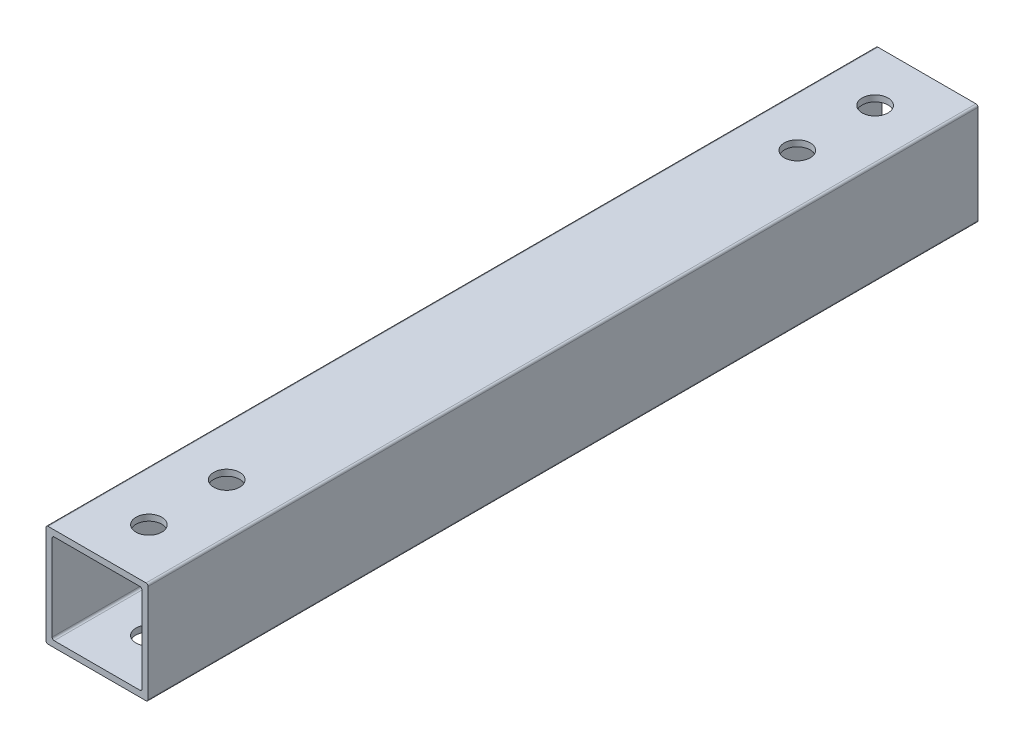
from build123d import *

# Parameters (mm, degrees)
BOSS_EXTRUDE1_DEPTH = 203.2
CUT_EXTRUDE1_REACH  = 2002.195
SKETCH2_R           = 3.175


with BuildPart() as part:
    # Sketch1 → Boss-Extrude1 (new body)
    with BuildSketch(Plane(origin=(0, 0, -2000), x_dir=(-1, 0, 0), z_dir=(0, 0, -1))):
        with BuildLine():
            Line((12.5, -12), (12.5, 12))
            ThreePointArc((12.5, 12), (12.353553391, 12.353553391), (12, 12.5))
            Line((12, 12.5), (-12, 12.5))
            ThreePointArc((-12, 12.5), (-12.353553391, 12.353553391), (-12.5, 12))
            Line((-12.5, 12), (-12.5, -12))
            ThreePointArc((-12.5, -12), (-12.353553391, -12.353553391), (-12, -12.5))
            Line((-12, -12.5), (12, -12.5))
            ThreePointArc((12, -12.5), (12.353553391, -12.353553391), (12.5, -12))
        make_face()
        with BuildLine():
            Line((11, 10.5), (11, -10.5))
            ThreePointArc((11, -10.5), (10.853553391, -10.853553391), (10.5, -11))
            Line((10.5, -11), (-10.5, -11))
            ThreePointArc((-10.5, -11), (-10.853553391, -10.853553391), (-11, -10.5))
            Line((-11, -10.5), (-11, 10.5))
            ThreePointArc((-11, 10.5), (-10.853553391, 10.853553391), (-10.5, 11))
            Line((-10.5, 11), (10.5, 11))
            ThreePointArc((10.5, 11), (10.853553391, 10.853553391), (11, 10.5))
        make_face(mode=Mode.SUBTRACT)
    extrude(amount=-BOSS_EXTRUDE1_DEPTH)

    # Cut-Extrude1: up to this face of the body (flat: up to its plane)
    cut_extrude1_end = Plane(part.part.faces().sort_by_distance((0, -12.5, -1898.4))[0])
    # Sketch2 → Cut-Extrude1 (cut, up to the picked face)
    with BuildSketch(Plane(origin=(0, 12.5, 0), x_dir=(1, 0, 0), z_dir=(0, 1, 0)), mode=Mode.PRIVATE) as cut_extrude1_sk1:
        with Locations(Location((0, 1987.3, 0), (0, 0, 180))):
            Circle(SKETCH2_R)
    cut_extrude1_tool1 = split(extrude(cut_extrude1_sk1.sketch, amount=-CUT_EXTRUDE1_REACH, mode=Mode.PRIVATE), bisect_by=cut_extrude1_end, keep=Keep.BOTH, mode=Mode.PRIVATE)
    # Sketch2 → Cut-Extrude1 (cut, up to the picked face)
    with BuildSketch(Plane(origin=(0, 12.5, 0), x_dir=(1, 0, 0), z_dir=(0, 1, 0)), mode=Mode.PRIVATE) as cut_extrude1_sk2:
        with Locations(Location((0, 1968.25, 0), (0, 0, 180))):
            Circle(SKETCH2_R)
    cut_extrude1_tool2 = split(extrude(cut_extrude1_sk2.sketch, amount=-CUT_EXTRUDE1_REACH, mode=Mode.PRIVATE), bisect_by=cut_extrude1_end, keep=Keep.BOTH, mode=Mode.PRIVATE)
    # Sketch2 → Cut-Extrude1 (cut, up to the picked face)
    with BuildSketch(Plane(origin=(0, 12.5, 0), x_dir=(1, 0, 0), z_dir=(0, 1, 0)), mode=Mode.PRIVATE) as cut_extrude1_sk3:
        with Locations(Location((0, 1828.55, 0), (0, 0, 180))):
            Circle(SKETCH2_R)
    cut_extrude1_tool3 = split(extrude(cut_extrude1_sk3.sketch, amount=-CUT_EXTRUDE1_REACH, mode=Mode.PRIVATE), bisect_by=cut_extrude1_end, keep=Keep.BOTH, mode=Mode.PRIVATE)
    # Sketch2 → Cut-Extrude1 (cut, up to the picked face)
    with BuildSketch(Plane(origin=(0, 12.5, 0), x_dir=(1, 0, 0), z_dir=(0, 1, 0)), mode=Mode.PRIVATE) as cut_extrude1_sk4:
        with Locations(Location((0, 1809.5, 0), (0, 0, 180))):
            Circle(SKETCH2_R)
    cut_extrude1_tool4 = split(extrude(cut_extrude1_sk4.sketch, amount=-CUT_EXTRUDE1_REACH, mode=Mode.PRIVATE), bisect_by=cut_extrude1_end, keep=Keep.BOTH, mode=Mode.PRIVATE)
    add(cut_extrude1_tool1.solids().sort_by(Axis((0, 12.5, -1987.3), (0, -1, 0)))[0], mode=Mode.SUBTRACT)
    add(cut_extrude1_tool2.solids().sort_by(Axis((0, 12.5, -1968.25), (0, -1, 0)))[0], mode=Mode.SUBTRACT)
    add(cut_extrude1_tool3.solids().sort_by(Axis((0, 12.5, -1828.55), (0, -1, 0)))[0], mode=Mode.SUBTRACT)
    add(cut_extrude1_tool4.solids().sort_by(Axis((0, 12.5, -1809.5), (0, -1, 0)))[0], mode=Mode.SUBTRACT)


solid = part.part
